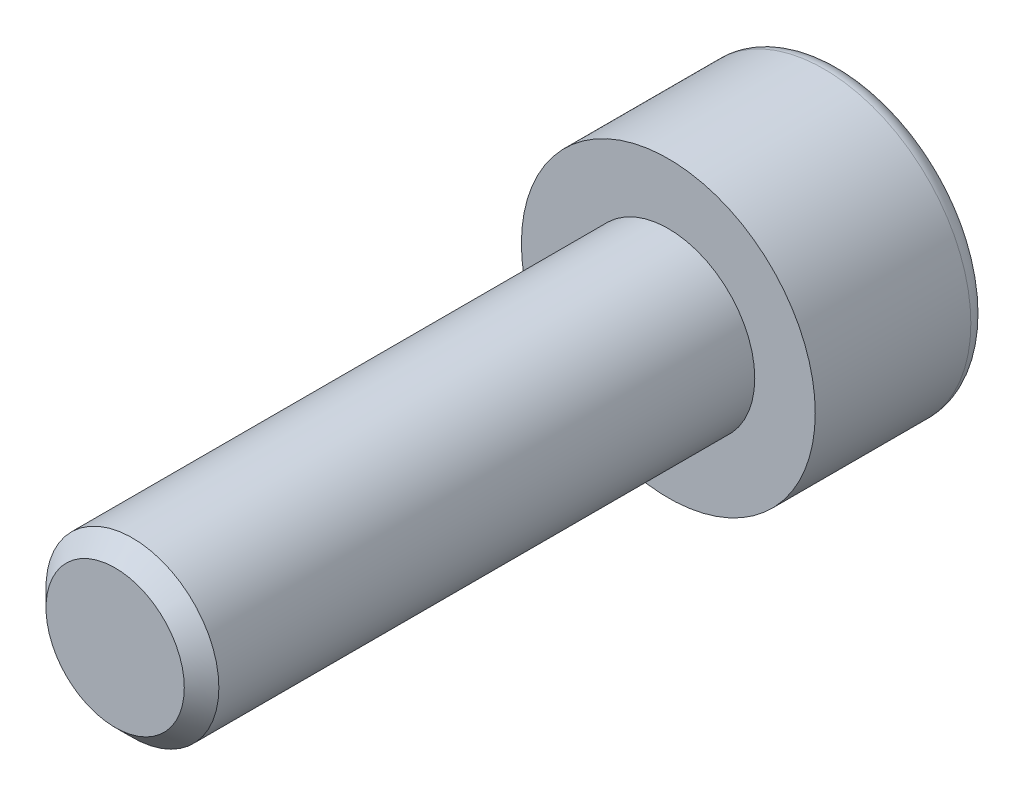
ISO-10303-21;
HEADER;
FILE_DESCRIPTION(('STEP AP214'),'2;1');
FILE_NAME('part.step','',(''),(''),'','','');
FILE_SCHEMA(('AUTOMOTIVE_DESIGN { 1 0 10303 214 1 1 1 1 }'));
ENDSEC;
DATA;
#1=APPLICATION_CONTEXT('core data for automotive mechanical design processes');
#2=APPLICATION_PROTOCOL_DEFINITION('international standard','automotive_design',2000,#1);
#3=PRODUCT_CONTEXT('',#1,'mechanical');
#4=PRODUCT('Part','Part','',(#3));
#5=PRODUCT_RELATED_PRODUCT_CATEGORY('part','',(#4));
#6=PRODUCT_DEFINITION_FORMATION('','',#4);
#7=PRODUCT_DEFINITION_CONTEXT('part definition',#1,'design');
#8=PRODUCT_DEFINITION('design','',#6,#7);
#9=PRODUCT_DEFINITION_SHAPE('','',#8);
#10=(LENGTH_UNIT() NAMED_UNIT(*) SI_UNIT(.MILLI.,.METRE.));
#11=(NAMED_UNIT(*) PLANE_ANGLE_UNIT() SI_UNIT($,.RADIAN.));
#12=(NAMED_UNIT(*) SI_UNIT($,.STERADIAN.) SOLID_ANGLE_UNIT());
#13=UNCERTAINTY_MEASURE_WITH_UNIT(LENGTH_MEASURE(1.E-05),#10,'distance_accuracy_value','');
#14=(GEOMETRIC_REPRESENTATION_CONTEXT(3) GLOBAL_UNCERTAINTY_ASSIGNED_CONTEXT((#13)) GLOBAL_UNIT_ASSIGNED_CONTEXT((#10,
#11,#12)) REPRESENTATION_CONTEXT('',''));
#15=CARTESIAN_POINT('',(0.,0.,0.));
#16=DIRECTION('',(0.,0.,1.));
#17=DIRECTION('',(1.,0.,0.));
#18=AXIS2_PLACEMENT_3D('',#15,#16,#17);
#19=CARTESIAN_POINT('',(0.,0.,-5.));
#20=DIRECTION('',(0.,0.,1.));
#21=DIRECTION('',(1.,0.,0.));
#22=AXIS2_PLACEMENT_3D('',#19,#20,#21);
#23=PLANE('',#22);
#24=CARTESIAN_POINT('',(0.,0.,-5.));
#25=DIRECTION('',(0.,0.,-1.));
#26=DIRECTION('',(-1.,0.,0.));
#27=AXIS2_PLACEMENT_3D('',#24,#25,#26);
#28=CIRCLE('',#27,3.75);
#29=CARTESIAN_POINT('',(-3.75,0.,-5.));
#30=VERTEX_POINT('',#29);
#31=EDGE_CURVE('E138',#30,#30,#28,.T.);
#32=ORIENTED_EDGE('',*,*,#31,.T.);
#33=EDGE_LOOP('',(#32));
#34=FACE_BOUND('',#33,.T.);
#35=DIRECTION('',(-0.86602540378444,0.499999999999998,0.));
#36=VECTOR('',#35,1.);
#37=CARTESIAN_POINT('',(0.,2.3094010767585,-5.));
#38=LINE('',#37,#36);
#39=CARTESIAN_POINT('',(2.,1.15470053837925,-5.));
#40=VERTEX_POINT('',#39);
#41=CARTESIAN_POINT('',(0.,2.3094010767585,-5.));
#42=VERTEX_POINT('',#41);
#43=EDGE_CURVE('E42',#40,#42,#38,.T.);
#44=ORIENTED_EDGE('',*,*,#43,.T.);
#45=DIRECTION('',(-0.866025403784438,-0.500000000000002,0.));
#46=VECTOR('',#45,1.);
#47=CARTESIAN_POINT('',(0.,2.3094010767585,-5.));
#48=LINE('',#47,#46);
#49=CARTESIAN_POINT('',(-2.,1.15470053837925,-5.));
#50=VERTEX_POINT('',#49);
#51=EDGE_CURVE('E82',#42,#50,#48,.T.);
#52=ORIENTED_EDGE('',*,*,#51,.T.);
#53=DIRECTION('',(0.,-1.,0.));
#54=VECTOR('',#53,1.);
#55=CARTESIAN_POINT('',(-1.99999999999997,-1.15470053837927,-5.));
#56=LINE('',#55,#54);
#57=CARTESIAN_POINT('',(-1.99999999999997,-1.15470053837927,-5.));
#58=VERTEX_POINT('',#57);
#59=EDGE_CURVE('E90',#50,#58,#56,.T.);
#60=ORIENTED_EDGE('',*,*,#59,.T.);
#61=DIRECTION('',(0.866025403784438,-0.500000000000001,0.));
#62=VECTOR('',#61,1.);
#63=CARTESIAN_POINT('',(0.,-2.3094010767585,-5.));
#64=LINE('',#63,#62);
#65=CARTESIAN_POINT('',(0.,-2.3094010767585,-5.));
#66=VERTEX_POINT('',#65);
#67=EDGE_CURVE('E108',#58,#66,#64,.T.);
#68=ORIENTED_EDGE('',*,*,#67,.T.);
#69=DIRECTION('',(0.86602540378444,0.499999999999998,0.));
#70=VECTOR('',#69,1.);
#71=CARTESIAN_POINT('',(0.,-2.3094010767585,-5.));
#72=LINE('',#71,#70);
#73=CARTESIAN_POINT('',(2.,-1.15470053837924,-5.));
#74=VERTEX_POINT('',#73);
#75=EDGE_CURVE('E111',#66,#74,#72,.T.);
#76=ORIENTED_EDGE('',*,*,#75,.T.);
#77=DIRECTION('',(0.,1.,0.));
#78=VECTOR('',#77,1.);
#79=CARTESIAN_POINT('',(2.,-1.15470053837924,-5.));
#80=LINE('',#79,#78);
#81=EDGE_CURVE('E101',#74,#40,#80,.T.);
#82=ORIENTED_EDGE('',*,*,#81,.T.);
#83=EDGE_LOOP('',(#44,#52,#60,#68,#76,#82));
#84=FACE_BOUND('',#83,.T.);
#85=ADVANCED_FACE('F28',(#34,#84),#23,.F.);
#86=CARTESIAN_POINT('',(0.,0.,-4.5));
#87=DIRECTION('',(0.,0.,-1.));
#88=DIRECTION('',(-1.,0.,0.));
#89=AXIS2_PLACEMENT_3D('',#86,#87,#88);
#90=TOROIDAL_SURFACE('',#89,3.75,0.5);
#91=ORIENTED_EDGE('',*,*,#31,.F.);
#92=EDGE_LOOP('',(#91));
#93=FACE_BOUND('',#92,.T.);
#94=CARTESIAN_POINT('',(0.,0.,-4.5));
#95=DIRECTION('',(0.,0.,-1.));
#96=DIRECTION('',(-1.,0.,0.));
#97=AXIS2_PLACEMENT_3D('',#94,#95,#96);
#98=CIRCLE('',#97,4.25);
#99=CARTESIAN_POINT('',(-4.25,0.,-4.5));
#100=VERTEX_POINT('',#99);
#101=EDGE_CURVE('E135',#100,#100,#98,.T.);
#102=ORIENTED_EDGE('',*,*,#101,.T.);
#103=EDGE_LOOP('',(#102));
#104=FACE_BOUND('',#103,.T.);
#105=ADVANCED_FACE('F157',(#93,#104),#90,.T.);
#106=CARTESIAN_POINT('',(0.,0.,0.));
#107=DIRECTION('',(0.,0.,-1.));
#108=DIRECTION('',(-1.,0.,0.));
#109=AXIS2_PLACEMENT_3D('',#106,#107,#108);
#110=CYLINDRICAL_SURFACE('',#109,4.25);
#111=CARTESIAN_POINT('',(0.,0.,0.));
#112=DIRECTION('',(0.,0.,-1.));
#113=DIRECTION('',(-1.,0.,0.));
#114=AXIS2_PLACEMENT_3D('',#111,#112,#113);
#115=CIRCLE('',#114,4.25);
#116=CARTESIAN_POINT('',(-4.25,0.,0.));
#117=VERTEX_POINT('',#116);
#118=EDGE_CURVE('E96',#117,#117,#115,.T.);
#119=CARTESIAN_POINT('',(-4.25,0.,-4.5));
#120=CARTESIAN_POINT('',(-4.25,0.,-4.453125));
#121=CARTESIAN_POINT('',(-4.25,0.,-4.40625));
#122=CARTESIAN_POINT('',(-4.25,0.,-4.3125));
#123=CARTESIAN_POINT('',(-4.25,0.,-4.265625));
#124=CARTESIAN_POINT('',(-4.25,0.,-4.171875));
#125=CARTESIAN_POINT('',(-4.25,0.,-4.125));
#126=CARTESIAN_POINT('',(-4.25,0.,-4.03125));
#127=CARTESIAN_POINT('',(-4.25,0.,-3.984375));
#128=CARTESIAN_POINT('',(-4.25,0.,-3.890625));
#129=CARTESIAN_POINT('',(-4.25,0.,-3.84375));
#130=CARTESIAN_POINT('',(-4.25,0.,-3.75));
#131=CARTESIAN_POINT('',(-4.25,0.,-3.703125));
#132=CARTESIAN_POINT('',(-4.25,0.,-3.609375));
#133=CARTESIAN_POINT('',(-4.25,0.,-3.5625));
#134=CARTESIAN_POINT('',(-4.25,0.,-3.46875));
#135=CARTESIAN_POINT('',(-4.25,0.,-3.421875));
#136=CARTESIAN_POINT('',(-4.25,0.,-3.328125));
#137=CARTESIAN_POINT('',(-4.25,0.,-3.28125));
#138=CARTESIAN_POINT('',(-4.25,0.,-3.1875));
#139=CARTESIAN_POINT('',(-4.25,0.,-3.140625));
#140=CARTESIAN_POINT('',(-4.25,0.,-3.046875));
#141=CARTESIAN_POINT('',(-4.25,0.,-3.));
#142=CARTESIAN_POINT('',(-4.25,0.,-2.90625));
#143=CARTESIAN_POINT('',(-4.25,0.,-2.859375));
#144=CARTESIAN_POINT('',(-4.25,0.,-2.765625));
#145=CARTESIAN_POINT('',(-4.25,0.,-2.71875));
#146=CARTESIAN_POINT('',(-4.25,0.,-2.625));
#147=CARTESIAN_POINT('',(-4.25,0.,-2.578125));
#148=CARTESIAN_POINT('',(-4.25,0.,-2.484375));
#149=CARTESIAN_POINT('',(-4.25,0.,-2.4375));
#150=CARTESIAN_POINT('',(-4.25,0.,-2.34375));
#151=CARTESIAN_POINT('',(-4.25,0.,-2.296875));
#152=CARTESIAN_POINT('',(-4.25,0.,-2.203125));
#153=CARTESIAN_POINT('',(-4.25,0.,-2.15625));
#154=CARTESIAN_POINT('',(-4.25,0.,-2.0625));
#155=CARTESIAN_POINT('',(-4.25,0.,-2.015625));
#156=CARTESIAN_POINT('',(-4.25,0.,-1.921875));
#157=CARTESIAN_POINT('',(-4.25,0.,-1.875));
#158=CARTESIAN_POINT('',(-4.25,0.,-1.78125));
#159=CARTESIAN_POINT('',(-4.25,0.,-1.734375));
#160=CARTESIAN_POINT('',(-4.25,0.,-1.640625));
#161=CARTESIAN_POINT('',(-4.25,0.,-1.59375));
#162=CARTESIAN_POINT('',(-4.25,0.,-1.5));
#163=CARTESIAN_POINT('',(-4.25,0.,-1.453125));
#164=CARTESIAN_POINT('',(-4.25,0.,-1.359375));
#165=CARTESIAN_POINT('',(-4.25,0.,-1.3125));
#166=CARTESIAN_POINT('',(-4.25,0.,-1.21875));
#167=CARTESIAN_POINT('',(-4.25,0.,-1.171875));
#168=CARTESIAN_POINT('',(-4.25,0.,-1.078125));
#169=CARTESIAN_POINT('',(-4.25,0.,-1.03125));
#170=CARTESIAN_POINT('',(-4.25,0.,-0.937500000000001));
#171=CARTESIAN_POINT('',(-4.25,0.,-0.890625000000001));
#172=CARTESIAN_POINT('',(-4.25,0.,-0.796875));
#173=CARTESIAN_POINT('',(-4.25,0.,-0.750000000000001));
#174=CARTESIAN_POINT('',(-4.25,0.,-0.65625));
#175=CARTESIAN_POINT('',(-4.25,0.,-0.609375));
#176=CARTESIAN_POINT('',(-4.25,0.,-0.515625));
#177=CARTESIAN_POINT('',(-4.25,0.,-0.46875));
#178=CARTESIAN_POINT('',(-4.25,0.,-0.375));
#179=CARTESIAN_POINT('',(-4.25,0.,-0.328125));
#180=CARTESIAN_POINT('',(-4.25,0.,-0.234375));
#181=CARTESIAN_POINT('',(-4.25,0.,-0.1875));
#182=CARTESIAN_POINT('',(-4.25,0.,-0.0937500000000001));
#183=CARTESIAN_POINT('',(-4.25,0.,-0.046875));
#184=CARTESIAN_POINT('',(-4.25,0.,0.));
#185=B_SPLINE_CURVE_WITH_KNOTS('',3,(#119,#120,#121,#122,#123,#124,#125,#126,#127,#128,#129,
#130,#131,#132,#133,#134,#135,#136,#137,#138,#139,#140,#141,#142,#143,#144,#145,#146,#147,#148,
#149,#150,#151,#152,#153,#154,#155,#156,#157,#158,#159,#160,#161,#162,#163,#164,#165,#166,#167,
#168,#169,#170,#171,#172,#173,#174,#175,#176,#177,#178,#179,#180,#181,#182,#183,#184),
.UNSPECIFIED.,.F.,.F.,(4,2,2,2,2,2,2,2,2,2,2,2,2,2,2,2,2,2,2,2,2,2,2,2,2,2,2,2,2,2,2,2,4),(0.,
0.140625,0.28125,0.421875,0.5625,0.703125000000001,0.843750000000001,0.984375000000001,1.125,
1.265625,1.40625,1.546875,1.6875,1.828125,1.96875,2.109375,2.25,2.390625,2.53125,2.671875,
2.8125,2.953125,3.09375,3.234375,3.375,3.515625,3.65625,3.796875,3.9375,4.078125,4.21875,
4.359375,4.5),.UNSPECIFIED.);
#186=EDGE_CURVE('BSEAM162',#100,#117,#185,.T.);
#187=ORIENTED_EDGE('',*,*,#101,.F.);
#188=ORIENTED_EDGE('',*,*,#118,.T.);
#189=ORIENTED_EDGE('',*,*,#186,.T.);
#190=ORIENTED_EDGE('',*,*,#186,.F.);
#191=EDGE_LOOP('',(#187,#189,#188,#190));
#192=FACE_BOUND('',#191,.T.);
#193=ADVANCED_FACE('F162',(#192),#110,.T.);
#194=CARTESIAN_POINT('',(0.,0.,0.));
#195=DIRECTION('',(0.,0.,-1.));
#196=DIRECTION('',(-1.,0.,0.));
#197=AXIS2_PLACEMENT_3D('',#194,#195,#196);
#198=PLANE('',#197);
#199=CARTESIAN_POINT('',(0.,0.,0.));
#200=DIRECTION('',(0.,0.,1.));
#201=DIRECTION('',(1.,0.,0.));
#202=AXIS2_PLACEMENT_3D('',#199,#200,#201);
#203=CIRCLE('',#202,2.5);
#204=CARTESIAN_POINT('',(2.5,0.,0.));
#205=VERTEX_POINT('',#204);
#206=EDGE_CURVE('E102',#205,#205,#203,.T.);
#207=ORIENTED_EDGE('',*,*,#206,.F.);
#208=EDGE_LOOP('',(#207));
#209=FACE_BOUND('',#208,.T.);
#210=ORIENTED_EDGE('',*,*,#118,.F.);
#211=EDGE_LOOP('',(#210));
#212=FACE_BOUND('',#211,.T.);
#213=ADVANCED_FACE('F170',(#209,#212),#198,.F.);
#214=CARTESIAN_POINT('',(0.,2.3094010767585,-2.5));
#215=DIRECTION('',(-0.499999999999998,-0.86602540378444,0.));
#216=DIRECTION('',(0.86602540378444,-0.499999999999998,0.));
#217=AXIS2_PLACEMENT_3D('',#214,#215,#216);
#218=PLANE('',#217);
#219=ORIENTED_EDGE('',*,*,#43,.F.);
#220=DIRECTION('',(0.,0.,-1.));
#221=VECTOR('',#220,1.);
#222=CARTESIAN_POINT('',(2.,1.15470053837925,-2.5));
#223=LINE('',#222,#221);
#224=CARTESIAN_POINT('',(2.,1.15470053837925,-2.5));
#225=VERTEX_POINT('',#224);
#226=EDGE_CURVE('E124',#225,#40,#223,.T.);
#227=ORIENTED_EDGE('',*,*,#226,.F.);
#228=DIRECTION('',(-0.86602540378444,0.499999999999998,0.));
#229=VECTOR('',#228,1.);
#230=CARTESIAN_POINT('',(0.,2.3094010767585,-2.5));
#231=LINE('',#230,#229);
#232=CARTESIAN_POINT('',(0.,2.3094010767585,-2.5));
#233=VERTEX_POINT('',#232);
#234=EDGE_CURVE('E95',#225,#233,#231,.T.);
#235=ORIENTED_EDGE('',*,*,#234,.T.);
#236=DIRECTION('',(0.,0.,-1.));
#237=VECTOR('',#236,1.);
#238=CARTESIAN_POINT('',(0.,2.3094010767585,-2.5));
#239=LINE('',#238,#237);
#240=EDGE_CURVE('E84',#233,#42,#239,.T.);
#241=ORIENTED_EDGE('',*,*,#240,.T.);
#242=EDGE_LOOP('',(#219,#227,#235,#241));
#243=FACE_BOUND('',#242,.T.);
#244=ADVANCED_FACE('F93',(#243),#218,.T.);
#245=CARTESIAN_POINT('',(0.,2.3094010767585,-2.5));
#246=DIRECTION('',(0.500000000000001,-0.866025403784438,0.));
#247=DIRECTION('',(0.866025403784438,0.500000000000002,0.));
#248=AXIS2_PLACEMENT_3D('',#245,#246,#247);
#249=PLANE('',#248);
#250=ORIENTED_EDGE('',*,*,#51,.F.);
#251=ORIENTED_EDGE('',*,*,#240,.F.);
#252=DIRECTION('',(-0.866025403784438,-0.500000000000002,0.));
#253=VECTOR('',#252,1.);
#254=CARTESIAN_POINT('',(0.,2.3094010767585,-2.5));
#255=LINE('',#254,#253);
#256=CARTESIAN_POINT('',(-2.,1.15470053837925,-2.5));
#257=VERTEX_POINT('',#256);
#258=EDGE_CURVE('E115',#233,#257,#255,.T.);
#259=ORIENTED_EDGE('',*,*,#258,.T.);
#260=DIRECTION('',(0.,0.,-1.));
#261=VECTOR('',#260,1.);
#262=CARTESIAN_POINT('',(-2.,1.15470053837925,-2.5));
#263=LINE('',#262,#261);
#264=EDGE_CURVE('E86',#257,#50,#263,.T.);
#265=ORIENTED_EDGE('',*,*,#264,.T.);
#266=EDGE_LOOP('',(#250,#251,#259,#265));
#267=FACE_BOUND('',#266,.T.);
#268=ADVANCED_FACE('F83',(#267),#249,.T.);
#269=CARTESIAN_POINT('',(-1.99999999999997,-1.15470053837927,-2.5));
#270=DIRECTION('',(1.,0.,0.));
#271=DIRECTION('',(0.,0.,-1.));
#272=AXIS2_PLACEMENT_3D('',#269,#270,#271);
#273=PLANE('',#272);
#274=ORIENTED_EDGE('',*,*,#59,.F.);
#275=ORIENTED_EDGE('',*,*,#264,.F.);
#276=DIRECTION('',(0.,-1.,0.));
#277=VECTOR('',#276,1.);
#278=CARTESIAN_POINT('',(-1.99999999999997,-1.15470053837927,-2.5));
#279=LINE('',#278,#277);
#280=CARTESIAN_POINT('',(-1.99999999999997,-1.15470053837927,-2.5));
#281=VERTEX_POINT('',#280);
#282=EDGE_CURVE('E117',#257,#281,#279,.T.);
#283=ORIENTED_EDGE('',*,*,#282,.T.);
#284=DIRECTION('',(0.,0.,-1.));
#285=VECTOR('',#284,1.);
#286=CARTESIAN_POINT('',(-1.99999999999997,-1.15470053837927,-2.5));
#287=LINE('',#286,#285);
#288=EDGE_CURVE('E130',#281,#58,#287,.T.);
#289=ORIENTED_EDGE('',*,*,#288,.T.);
#290=EDGE_LOOP('',(#274,#275,#283,#289));
#291=FACE_BOUND('',#290,.T.);
#292=ADVANCED_FACE('F185',(#291),#273,.T.);
#293=CARTESIAN_POINT('',(0.,-2.3094010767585,-2.5));
#294=DIRECTION('',(0.500000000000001,0.866025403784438,0.));
#295=DIRECTION('',(-0.866025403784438,0.500000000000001,0.));
#296=AXIS2_PLACEMENT_3D('',#293,#294,#295);
#297=PLANE('',#296);
#298=ORIENTED_EDGE('',*,*,#67,.F.);
#299=ORIENTED_EDGE('',*,*,#288,.F.);
#300=DIRECTION('',(0.866025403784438,-0.500000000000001,0.));
#301=VECTOR('',#300,1.);
#302=CARTESIAN_POINT('',(0.,-2.3094010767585,-2.5));
#303=LINE('',#302,#301);
#304=CARTESIAN_POINT('',(0.,-2.3094010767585,-2.5));
#305=VERTEX_POINT('',#304);
#306=EDGE_CURVE('E119',#281,#305,#303,.T.);
#307=ORIENTED_EDGE('',*,*,#306,.T.);
#308=DIRECTION('',(0.,0.,-1.));
#309=VECTOR('',#308,1.);
#310=CARTESIAN_POINT('',(0.,-2.3094010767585,-2.5));
#311=LINE('',#310,#309);
#312=EDGE_CURVE('E128',#305,#66,#311,.T.);
#313=ORIENTED_EDGE('',*,*,#312,.T.);
#314=EDGE_LOOP('',(#298,#299,#307,#313));
#315=FACE_BOUND('',#314,.T.);
#316=ADVANCED_FACE('F188',(#315),#297,.T.);
#317=CARTESIAN_POINT('',(0.,-2.3094010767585,-2.5));
#318=DIRECTION('',(-0.499999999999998,0.86602540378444,0.));
#319=DIRECTION('',(-0.86602540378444,-0.499999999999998,0.));
#320=AXIS2_PLACEMENT_3D('',#317,#318,#319);
#321=PLANE('',#320);
#322=ORIENTED_EDGE('',*,*,#75,.F.);
#323=ORIENTED_EDGE('',*,*,#312,.F.);
#324=DIRECTION('',(0.86602540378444,0.499999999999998,0.));
#325=VECTOR('',#324,1.);
#326=CARTESIAN_POINT('',(0.,-2.3094010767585,-2.5));
#327=LINE('',#326,#325);
#328=CARTESIAN_POINT('',(2.,-1.15470053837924,-2.5));
#329=VERTEX_POINT('',#328);
#330=EDGE_CURVE('E121',#305,#329,#327,.T.);
#331=ORIENTED_EDGE('',*,*,#330,.T.);
#332=DIRECTION('',(0.,0.,-1.));
#333=VECTOR('',#332,1.);
#334=CARTESIAN_POINT('',(2.,-1.15470053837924,-2.5));
#335=LINE('',#334,#333);
#336=EDGE_CURVE('E126',#329,#74,#335,.T.);
#337=ORIENTED_EDGE('',*,*,#336,.T.);
#338=EDGE_LOOP('',(#322,#323,#331,#337));
#339=FACE_BOUND('',#338,.T.);
#340=ADVANCED_FACE('F192',(#339),#321,.T.);
#341=CARTESIAN_POINT('',(2.,-1.15470053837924,-2.5));
#342=DIRECTION('',(-1.,0.,0.));
#343=DIRECTION('',(0.,0.,1.));
#344=AXIS2_PLACEMENT_3D('',#341,#342,#343);
#345=PLANE('',#344);
#346=ORIENTED_EDGE('',*,*,#81,.F.);
#347=ORIENTED_EDGE('',*,*,#336,.F.);
#348=DIRECTION('',(0.,1.,0.));
#349=VECTOR('',#348,1.);
#350=CARTESIAN_POINT('',(2.,-1.15470053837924,-2.5));
#351=LINE('',#350,#349);
#352=EDGE_CURVE('E49',#329,#225,#351,.T.);
#353=ORIENTED_EDGE('',*,*,#352,.T.);
#354=ORIENTED_EDGE('',*,*,#226,.T.);
#355=EDGE_LOOP('',(#346,#347,#353,#354));
#356=FACE_BOUND('',#355,.T.);
#357=ADVANCED_FACE('F196',(#356),#345,.T.);
#358=CARTESIAN_POINT('',(2.,1.15470053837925,-2.5));
#359=DIRECTION('',(0.,0.,1.));
#360=DIRECTION('',(1.,0.,0.));
#361=AXIS2_PLACEMENT_3D('',#358,#359,#360);
#362=PLANE('',#361);
#363=ORIENTED_EDGE('',*,*,#234,.F.);
#364=ORIENTED_EDGE('',*,*,#352,.F.);
#365=ORIENTED_EDGE('',*,*,#330,.F.);
#366=ORIENTED_EDGE('',*,*,#306,.F.);
#367=ORIENTED_EDGE('',*,*,#282,.F.);
#368=ORIENTED_EDGE('',*,*,#258,.F.);
#369=EDGE_LOOP('',(#363,#364,#365,#366,#367,#368));
#370=FACE_BOUND('',#369,.T.);
#371=ADVANCED_FACE('F200',(#370),#362,.F.);
#372=CARTESIAN_POINT('',(0.,0.,16.));
#373=DIRECTION('',(0.,0.,1.));
#374=DIRECTION('',(1.,0.,0.));
#375=AXIS2_PLACEMENT_3D('',#372,#373,#374);
#376=PLANE('',#375);
#377=CARTESIAN_POINT('',(0.,0.,16.));
#378=DIRECTION('',(0.,0.,1.));
#379=DIRECTION('',(1.,0.,0.));
#380=AXIS2_PLACEMENT_3D('',#377,#378,#379);
#381=CIRCLE('',#380,2.);
#382=CARTESIAN_POINT('',(2.,0.,16.));
#383=VERTEX_POINT('',#382);
#384=EDGE_CURVE('E35',#383,#383,#381,.T.);
#385=ORIENTED_EDGE('',*,*,#384,.T.);
#386=EDGE_LOOP('',(#385));
#387=FACE_BOUND('',#386,.T.);
#388=ADVANCED_FACE('F143',(#387),#376,.T.);
#389=CARTESIAN_POINT('',(0.,0.,0.));
#390=DIRECTION('',(0.,0.,1.));
#391=DIRECTION('',(1.,0.,0.));
#392=AXIS2_PLACEMENT_3D('',#389,#390,#391);
#393=CYLINDRICAL_SURFACE('',#392,2.5);
#394=CARTESIAN_POINT('',(0.,0.,15.5));
#395=DIRECTION('',(0.,0.,1.));
#396=DIRECTION('',(1.,0.,0.));
#397=AXIS2_PLACEMENT_3D('',#394,#395,#396);
#398=CIRCLE('',#397,2.5);
#399=CARTESIAN_POINT('',(2.5,0.,15.5));
#400=VERTEX_POINT('',#399);
#401=EDGE_CURVE('E11',#400,#400,#398,.F.);
#402=CARTESIAN_POINT('',(2.5,0.,15.5));
#403=CARTESIAN_POINT('',(2.5,0.,15.3385416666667));
#404=CARTESIAN_POINT('',(2.5,0.,15.1770833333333));
#405=CARTESIAN_POINT('',(2.5,0.,14.8541666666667));
#406=CARTESIAN_POINT('',(2.5,0.,14.6927083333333));
#407=CARTESIAN_POINT('',(2.5,0.,14.3697916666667));
#408=CARTESIAN_POINT('',(2.5,0.,14.2083333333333));
#409=CARTESIAN_POINT('',(2.5,0.,13.8854166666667));
#410=CARTESIAN_POINT('',(2.5,0.,13.7239583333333));
#411=CARTESIAN_POINT('',(2.5,0.,13.4010416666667));
#412=CARTESIAN_POINT('',(2.5,0.,13.2395833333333));
#413=CARTESIAN_POINT('',(2.5,0.,12.9166666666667));
#414=CARTESIAN_POINT('',(2.5,0.,12.7552083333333));
#415=CARTESIAN_POINT('',(2.5,0.,12.4322916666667));
#416=CARTESIAN_POINT('',(2.5,0.,12.2708333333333));
#417=CARTESIAN_POINT('',(2.5,0.,11.9479166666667));
#418=CARTESIAN_POINT('',(2.5,0.,11.7864583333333));
#419=CARTESIAN_POINT('',(2.5,0.,11.4635416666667));
#420=CARTESIAN_POINT('',(2.5,0.,11.3020833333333));
#421=CARTESIAN_POINT('',(2.5,0.,10.9791666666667));
#422=CARTESIAN_POINT('',(2.5,0.,10.8177083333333));
#423=CARTESIAN_POINT('',(2.5,0.,10.4947916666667));
#424=CARTESIAN_POINT('',(2.5,0.,10.3333333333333));
#425=CARTESIAN_POINT('',(2.5,0.,10.0104166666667));
#426=CARTESIAN_POINT('',(2.5,0.,9.84895833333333));
#427=CARTESIAN_POINT('',(2.5,0.,9.52604166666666));
#428=CARTESIAN_POINT('',(2.5,0.,9.36458333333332));
#429=CARTESIAN_POINT('',(2.5,0.,9.04166666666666));
#430=CARTESIAN_POINT('',(2.5,0.,8.88020833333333));
#431=CARTESIAN_POINT('',(2.5,0.,8.55729166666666));
#432=CARTESIAN_POINT('',(2.5,0.,8.39583333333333));
#433=CARTESIAN_POINT('',(2.5,0.,8.07291666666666));
#434=CARTESIAN_POINT('',(2.5,0.,7.91145833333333));
#435=CARTESIAN_POINT('',(2.5,0.,7.58854166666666));
#436=CARTESIAN_POINT('',(2.5,0.,7.42708333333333));
#437=CARTESIAN_POINT('',(2.5,0.,7.10416666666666));
#438=CARTESIAN_POINT('',(2.5,0.,6.94270833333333));
#439=CARTESIAN_POINT('',(2.5,0.,6.61979166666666));
#440=CARTESIAN_POINT('',(2.5,0.,6.45833333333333));
#441=CARTESIAN_POINT('',(2.5,0.,6.13541666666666));
#442=CARTESIAN_POINT('',(2.5,0.,5.97395833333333));
#443=CARTESIAN_POINT('',(2.5,0.,5.65104166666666));
#444=CARTESIAN_POINT('',(2.5,0.,5.48958333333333));
#445=CARTESIAN_POINT('',(2.5,0.,5.16666666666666));
#446=CARTESIAN_POINT('',(2.5,0.,5.00520833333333));
#447=CARTESIAN_POINT('',(2.5,0.,4.68229166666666));
#448=CARTESIAN_POINT('',(2.5,0.,4.52083333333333));
#449=CARTESIAN_POINT('',(2.5,0.,4.19791666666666));
#450=CARTESIAN_POINT('',(2.5,0.,4.03645833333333));
#451=CARTESIAN_POINT('',(2.5,0.,3.71354166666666));
#452=CARTESIAN_POINT('',(2.5,0.,3.55208333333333));
#453=CARTESIAN_POINT('',(2.5,0.,3.22916666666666));
#454=CARTESIAN_POINT('',(2.5,0.,3.06770833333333));
#455=CARTESIAN_POINT('',(2.5,0.,2.74479166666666));
#456=CARTESIAN_POINT('',(2.5,0.,2.58333333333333));
#457=CARTESIAN_POINT('',(2.5,0.,2.26041666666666));
#458=CARTESIAN_POINT('',(2.5,0.,2.09895833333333));
#459=CARTESIAN_POINT('',(2.5,0.,1.77604166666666));
#460=CARTESIAN_POINT('',(2.5,0.,1.61458333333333));
#461=CARTESIAN_POINT('',(2.5,0.,1.29166666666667));
#462=CARTESIAN_POINT('',(2.5,0.,1.13020833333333));
#463=CARTESIAN_POINT('',(2.5,0.,0.807291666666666));
#464=CARTESIAN_POINT('',(2.5,0.,0.645833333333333));
#465=CARTESIAN_POINT('',(2.5,0.,0.322916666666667));
#466=CARTESIAN_POINT('',(2.5,0.,0.161458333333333));
#467=CARTESIAN_POINT('',(2.5,0.,0.));
#468=B_SPLINE_CURVE_WITH_KNOTS('',3,(#402,#403,#404,#405,#406,#407,#408,#409,#410,#411,#412,
#413,#414,#415,#416,#417,#418,#419,#420,#421,#422,#423,#424,#425,#426,#427,#428,#429,#430,#431,
#432,#433,#434,#435,#436,#437,#438,#439,#440,#441,#442,#443,#444,#445,#446,#447,#448,#449,#450,
#451,#452,#453,#454,#455,#456,#457,#458,#459,#460,#461,#462,#463,#464,#465,#466,#467),
.UNSPECIFIED.,.F.,.F.,(4,2,2,2,2,2,2,2,2,2,2,2,2,2,2,2,2,2,2,2,2,2,2,2,2,2,2,2,2,2,2,2,4),(0.,
0.484375,0.968749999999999,1.453125,1.9375,2.421875,2.90625,3.390625,3.87499999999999,4.359375,
4.84375,5.32812499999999,5.81249999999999,6.296875,6.78124999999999,7.26562499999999,
7.74999999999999,8.23437499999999,8.71874999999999,9.20312499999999,9.68749999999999,10.171875,
10.65625,11.140625,11.625,12.109375,12.59375,13.078125,13.5625,14.046875,14.53125,15.015625,
15.5),.UNSPECIFIED.);
#469=EDGE_CURVE('BSEAM147',#400,#205,#468,.T.);
#470=ORIENTED_EDGE('',*,*,#401,.T.);
#471=ORIENTED_EDGE('',*,*,#206,.T.);
#472=ORIENTED_EDGE('',*,*,#469,.T.);
#473=ORIENTED_EDGE('',*,*,#469,.F.);
#474=EDGE_LOOP('',(#470,#472,#471,#473));
#475=FACE_BOUND('',#474,.T.);
#476=ADVANCED_FACE('F147',(#475),#393,.T.);
#477=CARTESIAN_POINT('',(0.,0.,16.));
#478=DIRECTION('',(0.,0.,-1.));
#479=DIRECTION('',(-1.,0.,0.));
#480=AXIS2_PLACEMENT_3D('',#477,#478,#479);
#481=CONICAL_SURFACE('',#480,2.,0.785398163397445);
#482=ORIENTED_EDGE('',*,*,#401,.F.);
#483=EDGE_LOOP('',(#482));
#484=FACE_BOUND('',#483,.T.);
#485=ORIENTED_EDGE('',*,*,#384,.F.);
#486=EDGE_LOOP('',(#485));
#487=FACE_BOUND('',#486,.T.);
#488=ADVANCED_FACE('F145',(#484,#487),#481,.T.);
#489=CLOSED_SHELL('',(#85,#105,#193,#213,#244,#268,#292,#316,#340,#357,#371,#388,#476,#488));
#490=MANIFOLD_SOLID_BREP('B2',#489);
#491=ADVANCED_BREP_SHAPE_REPRESENTATION('',(#18,#490),#14);
#492=SHAPE_DEFINITION_REPRESENTATION(#9,#491);
ENDSEC;
END-ISO-10303-21;
